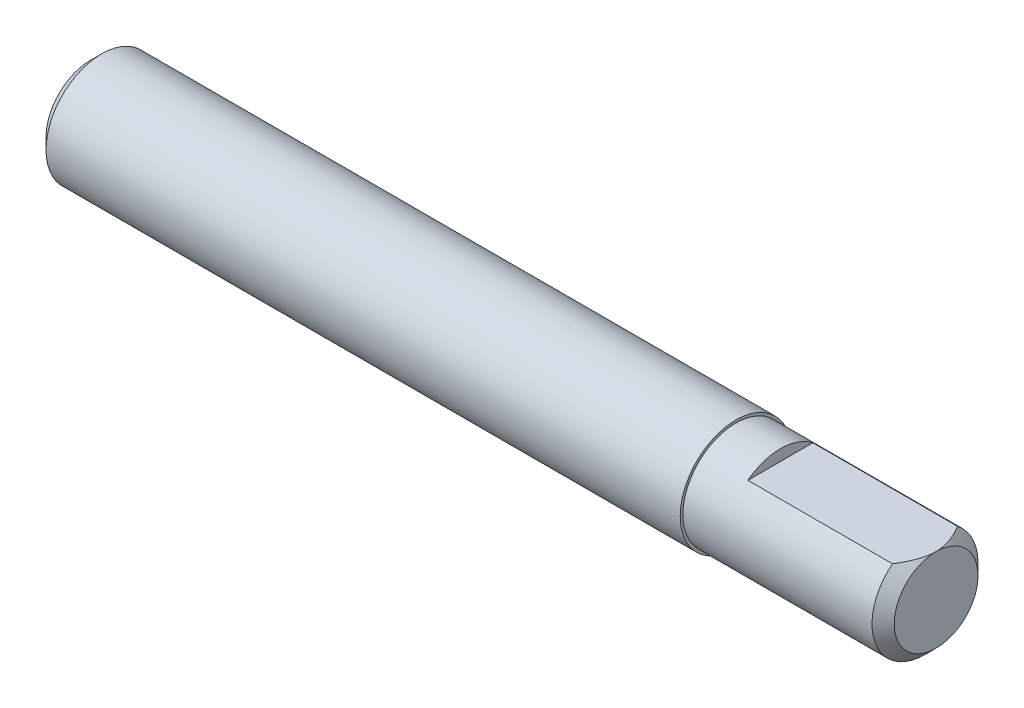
ISO-10303-21;
HEADER;
FILE_DESCRIPTION(('STEP AP214'),'2;1');
FILE_NAME('part.step','',(''),(''),'','','');
FILE_SCHEMA(('AUTOMOTIVE_DESIGN { 1 0 10303 214 1 1 1 1 }'));
ENDSEC;
DATA;
#1=APPLICATION_CONTEXT('core data for automotive mechanical design processes');
#2=APPLICATION_PROTOCOL_DEFINITION('international standard','automotive_design',2000,#1);
#3=PRODUCT_CONTEXT('',#1,'mechanical');
#4=PRODUCT('Part','Part','',(#3));
#5=PRODUCT_RELATED_PRODUCT_CATEGORY('part','',(#4));
#6=PRODUCT_DEFINITION_FORMATION('','',#4);
#7=PRODUCT_DEFINITION_CONTEXT('part definition',#1,'design');
#8=PRODUCT_DEFINITION('design','',#6,#7);
#9=PRODUCT_DEFINITION_SHAPE('','',#8);
#10=(LENGTH_UNIT() NAMED_UNIT(*) SI_UNIT(.MILLI.,.METRE.));
#11=(NAMED_UNIT(*) PLANE_ANGLE_UNIT() SI_UNIT($,.RADIAN.));
#12=(NAMED_UNIT(*) SI_UNIT($,.STERADIAN.) SOLID_ANGLE_UNIT());
#13=UNCERTAINTY_MEASURE_WITH_UNIT(LENGTH_MEASURE(1.E-05),#10,'distance_accuracy_value','');
#14=(GEOMETRIC_REPRESENTATION_CONTEXT(3) GLOBAL_UNCERTAINTY_ASSIGNED_CONTEXT((#13)) GLOBAL_UNIT_ASSIGNED_CONTEXT((#10,
#11,#12)) REPRESENTATION_CONTEXT('',''));
#15=CARTESIAN_POINT('',(0.,0.,0.));
#16=DIRECTION('',(0.,0.,1.));
#17=DIRECTION('',(1.,0.,0.));
#18=AXIS2_PLACEMENT_3D('',#15,#16,#17);
#19=CARTESIAN_POINT('',(29.,0.,0.));
#20=DIRECTION('',(1.,0.,0.));
#21=DIRECTION('',(0.,0.,-1.));
#22=AXIS2_PLACEMENT_3D('',#19,#20,#21);
#23=PLANE('',#22);
#24=CARTESIAN_POINT('',(29.,0.,0.));
#25=DIRECTION('',(1.,0.,0.));
#26=DIRECTION('',(0.,0.,-1.));
#27=AXIS2_PLACEMENT_3D('',#24,#25,#26);
#28=CIRCLE('',#27,2.5);
#29=CARTESIAN_POINT('',(29.,0.,2.5));
#30=VERTEX_POINT('',#29);
#31=EDGE_CURVE('E123',#30,#30,#28,.T.);
#32=ORIENTED_EDGE('',*,*,#31,.T.);
#33=EDGE_LOOP('',(#32));
#34=FACE_BOUND('',#33,.T.);
#35=CARTESIAN_POINT('',(29.,0.,0.));
#36=DIRECTION('',(1.,0.,0.));
#37=DIRECTION('',(0.,0.,-1.));
#38=AXIS2_PLACEMENT_3D('',#35,#36,#37);
#39=CIRCLE('',#38,2.38125);
#40=CARTESIAN_POINT('',(29.,0.,-2.38125));
#41=VERTEX_POINT('',#40);
#42=EDGE_CURVE('E125',#41,#41,#39,.T.);
#43=ORIENTED_EDGE('',*,*,#42,.F.);
#44=EDGE_LOOP('',(#43));
#45=FACE_BOUND('',#44,.T.);
#46=ADVANCED_FACE('F32',(#34,#45),#23,.T.);
#47=CARTESIAN_POINT('',(29.,0.,0.));
#48=DIRECTION('',(-1.,0.,0.));
#49=DIRECTION('',(0.,0.,1.));
#50=AXIS2_PLACEMENT_3D('',#47,#48,#49);
#51=CYLINDRICAL_SURFACE('',#50,2.5);
#52=CARTESIAN_POINT('',(0.500000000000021,0.,0.));
#53=DIRECTION('',(1.,0.,0.));
#54=DIRECTION('',(0.,0.,-1.));
#55=AXIS2_PLACEMENT_3D('',#52,#53,#54);
#56=CIRCLE('',#55,2.5);
#57=CARTESIAN_POINT('',(0.500000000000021,0.,2.5));
#58=VERTEX_POINT('',#57);
#59=EDGE_CURVE('E81',#58,#58,#56,.T.);
#60=CARTESIAN_POINT('',(0.500000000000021,0.,2.5));
#61=CARTESIAN_POINT('',(0.796875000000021,0.,2.5));
#62=CARTESIAN_POINT('',(1.09375000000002,0.,2.5));
#63=CARTESIAN_POINT('',(1.68750000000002,0.,2.5));
#64=CARTESIAN_POINT('',(1.98437500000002,0.,2.5));
#65=CARTESIAN_POINT('',(2.57812500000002,0.,2.5));
#66=CARTESIAN_POINT('',(2.87500000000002,0.,2.5));
#67=CARTESIAN_POINT('',(3.46875000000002,0.,2.5));
#68=CARTESIAN_POINT('',(3.76562500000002,0.,2.5));
#69=CARTESIAN_POINT('',(4.35937500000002,0.,2.5));
#70=CARTESIAN_POINT('',(4.65625000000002,0.,2.5));
#71=CARTESIAN_POINT('',(5.25000000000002,0.,2.5));
#72=CARTESIAN_POINT('',(5.54687500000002,0.,2.5));
#73=CARTESIAN_POINT('',(6.14062500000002,0.,2.5));
#74=CARTESIAN_POINT('',(6.43750000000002,0.,2.5));
#75=CARTESIAN_POINT('',(7.03125000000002,0.,2.5));
#76=CARTESIAN_POINT('',(7.32812500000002,0.,2.5));
#77=CARTESIAN_POINT('',(7.92187500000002,0.,2.5));
#78=CARTESIAN_POINT('',(8.21875000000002,0.,2.5));
#79=CARTESIAN_POINT('',(8.81250000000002,0.,2.5));
#80=CARTESIAN_POINT('',(9.10937500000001,0.,2.5));
#81=CARTESIAN_POINT('',(9.70312500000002,0.,2.5));
#82=CARTESIAN_POINT('',(10.,0.,2.5));
#83=CARTESIAN_POINT('',(10.59375,0.,2.5));
#84=CARTESIAN_POINT('',(10.890625,0.,2.5));
#85=CARTESIAN_POINT('',(11.484375,0.,2.5));
#86=CARTESIAN_POINT('',(11.78125,0.,2.5));
#87=CARTESIAN_POINT('',(12.375,0.,2.5));
#88=CARTESIAN_POINT('',(12.671875,0.,2.5));
#89=CARTESIAN_POINT('',(13.265625,0.,2.5));
#90=CARTESIAN_POINT('',(13.5625,0.,2.5));
#91=CARTESIAN_POINT('',(14.15625,0.,2.5));
#92=CARTESIAN_POINT('',(14.453125,0.,2.5));
#93=CARTESIAN_POINT('',(15.046875,0.,2.5));
#94=CARTESIAN_POINT('',(15.34375,0.,2.5));
#95=CARTESIAN_POINT('',(15.9375,0.,2.5));
#96=CARTESIAN_POINT('',(16.234375,0.,2.5));
#97=CARTESIAN_POINT('',(16.828125,0.,2.5));
#98=CARTESIAN_POINT('',(17.125,0.,2.5));
#99=CARTESIAN_POINT('',(17.71875,0.,2.5));
#100=CARTESIAN_POINT('',(18.015625,0.,2.5));
#101=CARTESIAN_POINT('',(18.609375,0.,2.5));
#102=CARTESIAN_POINT('',(18.90625,0.,2.5));
#103=CARTESIAN_POINT('',(19.5,0.,2.5));
#104=CARTESIAN_POINT('',(19.796875,0.,2.5));
#105=CARTESIAN_POINT('',(20.390625,0.,2.5));
#106=CARTESIAN_POINT('',(20.6875,0.,2.5));
#107=CARTESIAN_POINT('',(21.28125,0.,2.5));
#108=CARTESIAN_POINT('',(21.578125,0.,2.5));
#109=CARTESIAN_POINT('',(22.171875,0.,2.5));
#110=CARTESIAN_POINT('',(22.46875,0.,2.5));
#111=CARTESIAN_POINT('',(23.0625,0.,2.5));
#112=CARTESIAN_POINT('',(23.359375,0.,2.5));
#113=CARTESIAN_POINT('',(23.953125,0.,2.5));
#114=CARTESIAN_POINT('',(24.25,0.,2.5));
#115=CARTESIAN_POINT('',(24.84375,0.,2.5));
#116=CARTESIAN_POINT('',(25.140625,0.,2.5));
#117=CARTESIAN_POINT('',(25.734375,0.,2.5));
#118=CARTESIAN_POINT('',(26.03125,0.,2.5));
#119=CARTESIAN_POINT('',(26.625,0.,2.5));
#120=CARTESIAN_POINT('',(26.921875,0.,2.5));
#121=CARTESIAN_POINT('',(27.515625,0.,2.5));
#122=CARTESIAN_POINT('',(27.8125,0.,2.5));
#123=CARTESIAN_POINT('',(28.40625,0.,2.5));
#124=CARTESIAN_POINT('',(28.703125,0.,2.5));
#125=CARTESIAN_POINT('',(29.,0.,2.5));
#126=B_SPLINE_CURVE_WITH_KNOTS('',3,(#60,#61,#62,#63,#64,#65,#66,#67,#68,#69,#70,#71,#72,#73,
#74,#75,#76,#77,#78,#79,#80,#81,#82,#83,#84,#85,#86,#87,#88,#89,#90,#91,#92,#93,#94,#95,#96,#97,
#98,#99,#100,#101,#102,#103,#104,#105,#106,#107,#108,#109,#110,#111,#112,#113,#114,#115,#116,
#117,#118,#119,#120,#121,#122,#123,#124,#125),.UNSPECIFIED.,.F.,.F.,(4,2,2,2,2,2,2,2,2,2,2,2,2,
2,2,2,2,2,2,2,2,2,2,2,2,2,2,2,2,2,2,2,4),(0.,0.890624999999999,1.78125,2.671875,3.5625,4.453125,
5.34374999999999,6.234375,7.125,8.01562499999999,8.90624999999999,9.79687499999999,10.6875,
11.578125,12.46875,13.359375,14.25,15.140625,16.03125,16.921875,17.8125,18.703125,19.59375,
20.484375,21.375,22.265625,23.15625,24.046875,24.9375,25.828125,26.71875,27.609375,28.5),.UNSPECIFIED.);
#127=EDGE_CURVE('BSEAM108',#58,#30,#126,.T.);
#128=ORIENTED_EDGE('',*,*,#59,.T.);
#129=ORIENTED_EDGE('',*,*,#31,.F.);
#130=ORIENTED_EDGE('',*,*,#127,.T.);
#131=ORIENTED_EDGE('',*,*,#127,.F.);
#132=EDGE_LOOP('',(#128,#130,#129,#131));
#133=FACE_BOUND('',#132,.T.);
#134=ADVANCED_FACE('F108',(#133),#51,.T.);
#135=CARTESIAN_POINT('',(0.,0.,0.));
#136=DIRECTION('',(1.,0.,0.));
#137=DIRECTION('',(0.,0.,-1.));
#138=AXIS2_PLACEMENT_3D('',#135,#136,#137);
#139=PLANE('',#138);
#140=CARTESIAN_POINT('',(0.,0.,0.));
#141=DIRECTION('',(1.,0.,0.));
#142=DIRECTION('',(0.,0.,-1.));
#143=AXIS2_PLACEMENT_3D('',#140,#141,#142);
#144=CIRCLE('',#143,1.99999999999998);
#145=CARTESIAN_POINT('',(0.,0.,-1.99999999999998));
#146=VERTEX_POINT('',#145);
#147=EDGE_CURVE('E75',#146,#146,#144,.F.);
#148=ORIENTED_EDGE('',*,*,#147,.T.);
#149=EDGE_LOOP('',(#148));
#150=FACE_BOUND('',#149,.T.);
#151=ADVANCED_FACE('F105',(#150),#139,.F.);
#152=CARTESIAN_POINT('',(38.,0.,0.));
#153=DIRECTION('',(-1.,0.,0.));
#154=DIRECTION('',(0.,0.,1.));
#155=AXIS2_PLACEMENT_3D('',#152,#153,#154);
#156=CYLINDRICAL_SURFACE('',#155,2.38125);
#157=DIRECTION('',(-1.,0.,0.));
#158=VECTOR('',#157,1.);
#159=CARTESIAN_POINT('',(38.,1.88125,-1.45988013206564));
#160=LINE('',#159,#158);
#161=CARTESIAN_POINT('',(31.,1.88125,-1.45988013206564));
#162=VERTEX_POINT('',#161);
#163=CARTESIAN_POINT('',(37.5,1.88125,-1.45988013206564));
#164=VERTEX_POINT('',#163);
#165=EDGE_CURVE('E60',#162,#164,#160,.F.);
#166=ORIENTED_EDGE('',*,*,#165,.T.);
#167=CARTESIAN_POINT('',(37.5,0.,0.));
#168=DIRECTION('',(1.,0.,0.));
#169=DIRECTION('',(0.,0.,-1.));
#170=AXIS2_PLACEMENT_3D('',#167,#168,#169);
#171=CIRCLE('',#170,2.38125);
#172=CARTESIAN_POINT('',(37.5,1.88125,1.45988013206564));
#173=VERTEX_POINT('',#172);
#174=EDGE_CURVE('E11',#164,#173,#171,.F.);
#175=ORIENTED_EDGE('',*,*,#174,.T.);
#176=DIRECTION('',(-1.,0.,0.));
#177=VECTOR('',#176,1.);
#178=CARTESIAN_POINT('',(38.,1.88125,1.45988013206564));
#179=LINE('',#178,#177);
#180=CARTESIAN_POINT('',(31.,1.88125,1.45988013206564));
#181=VERTEX_POINT('',#180);
#182=EDGE_CURVE('E65',#173,#181,#179,.T.);
#183=ORIENTED_EDGE('',*,*,#182,.T.);
#184=CARTESIAN_POINT('',(31.,0.,0.));
#185=DIRECTION('',(-1.,0.,0.));
#186=DIRECTION('',(0.,0.,1.));
#187=AXIS2_PLACEMENT_3D('',#184,#185,#186);
#188=CIRCLE('',#187,2.38125);
#189=EDGE_CURVE('E70',#181,#162,#188,.T.);
#190=ORIENTED_EDGE('',*,*,#189,.T.);
#191=EDGE_LOOP('',(#166,#175,#183,#190));
#192=FACE_BOUND('',#191,.T.);
#193=ORIENTED_EDGE('',*,*,#42,.T.);
#194=EDGE_LOOP('',(#193));
#195=FACE_BOUND('',#194,.T.);
#196=ADVANCED_FACE('F72',(#192,#195),#156,.T.);
#197=CARTESIAN_POINT('',(38.,0.,0.));
#198=DIRECTION('',(1.,0.,0.));
#199=DIRECTION('',(0.,0.,-1.));
#200=AXIS2_PLACEMENT_3D('',#197,#198,#199);
#201=PLANE('',#200);
#202=CARTESIAN_POINT('',(38.,0.,0.));
#203=DIRECTION('',(1.,0.,0.));
#204=DIRECTION('',(0.,0.,-1.));
#205=AXIS2_PLACEMENT_3D('',#202,#203,#204);
#206=CIRCLE('',#205,1.88124999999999);
#207=CARTESIAN_POINT('',(38.,1.88125,0.));
#208=VERTEX_POINT('',#207);
#209=EDGE_CURVE('E74',#208,#208,#206,.T.);
#210=ORIENTED_EDGE('',*,*,#209,.T.);
#211=EDGE_LOOP('',(#210));
#212=FACE_BOUND('',#211,.T.);
#213=ADVANCED_FACE('F99',(#212),#201,.T.);
#214=CARTESIAN_POINT('',(0.500000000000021,0.,0.));
#215=DIRECTION('',(1.,0.,0.));
#216=DIRECTION('',(0.,0.,-1.));
#217=AXIS2_PLACEMENT_3D('',#214,#215,#216);
#218=CONICAL_SURFACE('',#217,2.5,0.78539816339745);
#219=ORIENTED_EDGE('',*,*,#147,.F.);
#220=EDGE_LOOP('',(#219));
#221=FACE_BOUND('',#220,.T.);
#222=ORIENTED_EDGE('',*,*,#59,.F.);
#223=EDGE_LOOP('',(#222));
#224=FACE_BOUND('',#223,.T.);
#225=ADVANCED_FACE('F98',(#221,#224),#218,.T.);
#226=CARTESIAN_POINT('',(31.,2.38125,-5.));
#227=DIRECTION('',(-1.,0.,0.));
#228=DIRECTION('',(0.,0.,1.));
#229=AXIS2_PLACEMENT_3D('',#226,#227,#228);
#230=PLANE('',#229);
#231=DIRECTION('',(0.,0.,1.));
#232=VECTOR('',#231,1.);
#233=CARTESIAN_POINT('',(31.,1.88125,-5.));
#234=LINE('',#233,#232);
#235=EDGE_CURVE('E63',#162,#181,#234,.T.);
#236=ORIENTED_EDGE('',*,*,#235,.F.);
#237=ORIENTED_EDGE('',*,*,#189,.F.);
#238=EDGE_LOOP('',(#236,#237));
#239=FACE_BOUND('',#238,.T.);
#240=ADVANCED_FACE('F69',(#239),#230,.F.);
#241=CARTESIAN_POINT('',(38.,1.88125,-5.));
#242=DIRECTION('',(0.,-1.,0.));
#243=DIRECTION('',(1.,0.,0.));
#244=AXIS2_PLACEMENT_3D('',#241,#242,#243);
#245=PLANE('',#244);
#246=CARTESIAN_POINT('',(37.5,1.88125,1.45988013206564));
#247=CARTESIAN_POINT('',(37.5423062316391,1.88125,1.39079427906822));
#248=CARTESIAN_POINT('',(37.5833460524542,1.88125,1.32086648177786));
#249=CARTESIAN_POINT('',(37.6619921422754,1.88125,1.17880249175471));
#250=CARTESIAN_POINT('',(37.6995861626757,1.88125,1.10665955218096));
#251=CARTESIAN_POINT('',(37.769219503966,1.88125,0.96201353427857));
#252=CARTESIAN_POINT('',(37.8013777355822,1.88125,0.889568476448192));
#253=CARTESIAN_POINT('',(37.859920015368,1.88125,0.742440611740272));
#254=CARTESIAN_POINT('',(37.8863115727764,1.88125,0.667760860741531));
#255=CARTESIAN_POINT('',(37.9233410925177,1.88125,0.544394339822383));
#256=CARTESIAN_POINT('',(37.9361876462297,1.88125,0.496369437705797));
#257=CARTESIAN_POINT('',(37.9586126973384,1.88125,0.399562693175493));
#258=CARTESIAN_POINT('',(37.9681918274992,1.88125,0.350780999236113));
#259=CARTESIAN_POINT('',(37.9838504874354,1.88125,0.25186466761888));
#260=CARTESIAN_POINT('',(37.9898726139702,1.88125,0.201720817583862));
#261=CARTESIAN_POINT('',(37.9979644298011,1.88125,0.101056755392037));
#262=CARTESIAN_POINT('',(38.000029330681,1.88125,0.0505361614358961));
#263=CARTESIAN_POINT('',(38.,1.88125,0.));
#264=B_SPLINE_CURVE_WITH_KNOTS('',3,(#246,#247,#248,#249,#250,#251,#252,#253,#254,#255,#256,
#257,#258,#259,#260,#261,#262,#263),.UNSPECIFIED.,.F.,.F.,(4,2,2,2,2,2,2,2,4),(0.,
0.243103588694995,0.487040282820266,0.724641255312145,0.961930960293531,1.11097479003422,
1.25998973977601,1.41134808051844,1.56288945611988),.UNSPECIFIED.);
#265=EDGE_CURVE('E78',#173,#208,#264,.T.);
#266=ORIENTED_EDGE('',*,*,#265,.T.);
#267=CARTESIAN_POINT('',(38.,1.88124999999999,0.));
#268=CARTESIAN_POINT('',(38.0000484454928,1.88125,-0.0578500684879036));
#269=CARTESIAN_POINT('',(37.997332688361,1.88125,-0.115670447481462));
#270=CARTESIAN_POINT('',(37.9867550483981,1.88125,-0.230729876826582));
#271=CARTESIAN_POINT('',(37.9789032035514,1.88125,-0.287969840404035));
#272=CARTESIAN_POINT('',(37.9586049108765,1.88125,-0.400620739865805));
#273=CARTESIAN_POINT('',(37.9462378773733,1.88125,-0.456046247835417));
#274=CARTESIAN_POINT('',(37.9174582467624,1.88125,-0.565846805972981));
#275=CARTESIAN_POINT('',(37.90104398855,1.88125,-0.620221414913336));
#276=CARTESIAN_POINT('',(37.8598362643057,1.88125,-0.74240305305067));
#277=CARTESIAN_POINT('',(37.8339777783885,1.88125,-0.809848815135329));
#278=CARTESIAN_POINT('',(37.7778034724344,1.88125,-0.942880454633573));
#279=CARTESIAN_POINT('',(37.747484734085,1.88125,-1.008465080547));
#280=CARTESIAN_POINT('',(37.6826217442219,1.88125,-1.1393779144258));
#281=CARTESIAN_POINT('',(37.6479962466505,1.88125,-1.20466541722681));
#282=CARTESIAN_POINT('',(37.5759307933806,1.88125,-1.3334910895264));
#283=CARTESIAN_POINT('',(37.5384970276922,1.88125,-1.39703270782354));
#284=CARTESIAN_POINT('',(37.5,1.88125,-1.45988013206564));
#285=B_SPLINE_CURVE_WITH_KNOTS('',3,(#267,#268,#269,#270,#271,#272,#273,#274,#275,#276,#277,
#278,#279,#280,#281,#282,#283,#284),.UNSPECIFIED.,.F.,.F.,(4,2,2,2,2,2,2,2,4),(0.,
0.173439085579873,0.346540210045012,0.516732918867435,0.686995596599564,0.90348559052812,
1.1201178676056,1.34174017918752,1.56288758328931),.UNSPECIFIED.);
#286=EDGE_CURVE('E41',#208,#164,#285,.T.);
#287=ORIENTED_EDGE('',*,*,#286,.T.);
#288=ORIENTED_EDGE('',*,*,#165,.F.);
#289=ORIENTED_EDGE('',*,*,#235,.T.);
#290=ORIENTED_EDGE('',*,*,#182,.F.);
#291=EDGE_LOOP('',(#266,#287,#288,#289,#290));
#292=FACE_BOUND('',#291,.T.);
#293=ADVANCED_FACE('F62',(#292),#245,.F.);
#294=CARTESIAN_POINT('',(38.,0.,0.));
#295=DIRECTION('',(-1.,0.,0.));
#296=DIRECTION('',(0.,0.,1.));
#297=AXIS2_PLACEMENT_3D('',#294,#295,#296);
#298=CONICAL_SURFACE('',#297,1.88124999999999,0.785398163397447);
#299=ORIENTED_EDGE('',*,*,#265,.F.);
#300=ORIENTED_EDGE('',*,*,#174,.F.);
#301=ORIENTED_EDGE('',*,*,#286,.F.);
#302=ORIENTED_EDGE('',*,*,#209,.F.);
#303=EDGE_LOOP('',(#299,#300,#301,#302));
#304=FACE_BOUND('',#303,.T.);
#305=ADVANCED_FACE('F34',(#304),#298,.T.);
#306=CLOSED_SHELL('',(#46,#134,#151,#196,#213,#225,#240,#293,#305));
#307=MANIFOLD_SOLID_BREP('B2',#306);
#308=ADVANCED_BREP_SHAPE_REPRESENTATION('',(#18,#307),#14);
#309=SHAPE_DEFINITION_REPRESENTATION(#9,#308);
ENDSEC;
END-ISO-10303-21;
